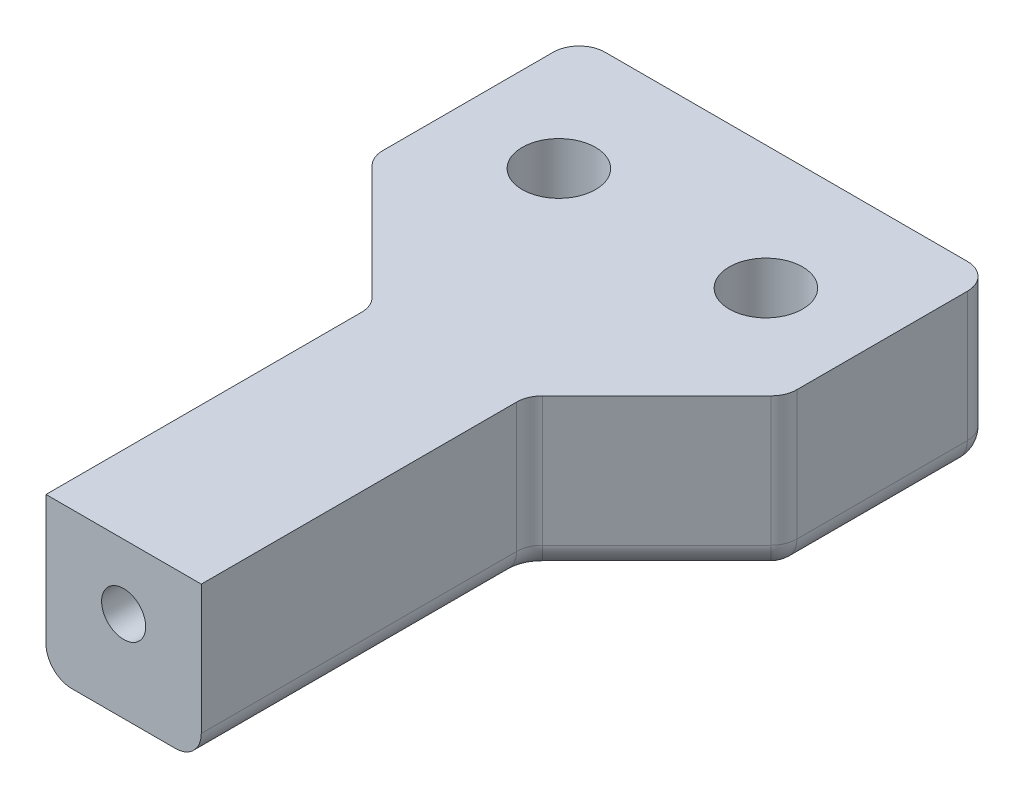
ISO-10303-21;
HEADER;
FILE_DESCRIPTION(('STEP AP214'),'2;1');
FILE_NAME('part.step','',(''),(''),'','','');
FILE_SCHEMA(('AUTOMOTIVE_DESIGN { 1 0 10303 214 1 1 1 1 }'));
ENDSEC;
DATA;
#1=APPLICATION_CONTEXT('core data for automotive mechanical design processes');
#2=APPLICATION_PROTOCOL_DEFINITION('international standard','automotive_design',2000,#1);
#3=PRODUCT_CONTEXT('',#1,'mechanical');
#4=PRODUCT('Part','Part','',(#3));
#5=PRODUCT_RELATED_PRODUCT_CATEGORY('part','',(#4));
#6=PRODUCT_DEFINITION_FORMATION('','',#4);
#7=PRODUCT_DEFINITION_CONTEXT('part definition',#1,'design');
#8=PRODUCT_DEFINITION('design','',#6,#7);
#9=PRODUCT_DEFINITION_SHAPE('','',#8);
#10=(LENGTH_UNIT() NAMED_UNIT(*) SI_UNIT(.MILLI.,.METRE.));
#11=(NAMED_UNIT(*) PLANE_ANGLE_UNIT() SI_UNIT($,.RADIAN.));
#12=(NAMED_UNIT(*) SI_UNIT($,.STERADIAN.) SOLID_ANGLE_UNIT());
#13=UNCERTAINTY_MEASURE_WITH_UNIT(LENGTH_MEASURE(1.E-05),#10,'distance_accuracy_value','');
#14=(GEOMETRIC_REPRESENTATION_CONTEXT(3) GLOBAL_UNCERTAINTY_ASSIGNED_CONTEXT((#13)) GLOBAL_UNIT_ASSIGNED_CONTEXT((#10,
#11,#12)) REPRESENTATION_CONTEXT('',''));
#15=CARTESIAN_POINT('',(0.,0.,0.));
#16=DIRECTION('',(0.,0.,1.));
#17=DIRECTION('',(1.,0.,0.));
#18=AXIS2_PLACEMENT_3D('',#15,#16,#17);
#19=CARTESIAN_POINT('',(-12.7,9.525,63.5));
#20=DIRECTION('',(1.,0.,0.));
#21=DIRECTION('',(0.,0.,-1.));
#22=AXIS2_PLACEMENT_3D('',#19,#20,#21);
#23=PLANE('',#22);
#24=DIRECTION('',(0.,0.,1.));
#25=VECTOR('',#24,1.);
#26=CARTESIAN_POINT('',(-12.7,1.5875,63.5));
#27=LINE('',#26,#25);
#28=CARTESIAN_POINT('',(-12.7,1.5875,52.3875));
#29=VERTEX_POINT('',#28);
#30=CARTESIAN_POINT('',(-12.7,1.5875,62.8424359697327));
#31=VERTEX_POINT('',#30);
#32=EDGE_CURVE('E396',#29,#31,#27,.T.);
#33=ORIENTED_EDGE('',*,*,#32,.T.);
#34=DIRECTION('',(0.,1.,0.));
#35=VECTOR('',#34,1.);
#36=CARTESIAN_POINT('',(-12.7,9.525,62.8424359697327));
#37=LINE('',#36,#35);
#38=CARTESIAN_POINT('',(-12.7,9.525,62.8424359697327));
#39=VERTEX_POINT('',#38);
#40=EDGE_CURVE('E399',#31,#39,#37,.T.);
#41=ORIENTED_EDGE('',*,*,#40,.T.);
#42=DIRECTION('',(0.,0.,1.));
#43=VECTOR('',#42,1.);
#44=CARTESIAN_POINT('',(-12.7,9.525,63.5));
#45=LINE('',#44,#43);
#46=CARTESIAN_POINT('',(-12.7,9.525,52.3875));
#47=VERTEX_POINT('',#46);
#48=EDGE_CURVE('E265',#47,#39,#45,.T.);
#49=ORIENTED_EDGE('',*,*,#48,.F.);
#50=DIRECTION('',(0.,-1.,0.));
#51=VECTOR('',#50,1.);
#52=CARTESIAN_POINT('',(-12.7,9.525,52.3875));
#53=LINE('',#52,#51);
#54=EDGE_CURVE('E393',#47,#29,#53,.T.);
#55=ORIENTED_EDGE('',*,*,#54,.T.);
#56=EDGE_LOOP('',(#33,#41,#49,#55));
#57=FACE_BOUND('',#56,.T.);
#58=ADVANCED_FACE('F41',(#57),#23,.F.);
#59=CARTESIAN_POINT('',(-4.7625,9.525,91.44));
#60=DIRECTION('',(1.,0.,0.));
#61=DIRECTION('',(0.,0.,-1.));
#62=AXIS2_PLACEMENT_3D('',#59,#60,#61);
#63=PLANE('',#62);
#64=DIRECTION('',(0.,1.,0.));
#65=VECTOR('',#64,1.);
#66=CARTESIAN_POINT('',(-4.76249999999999,0.,72.0950640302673));
#67=LINE('',#66,#65);
#68=CARTESIAN_POINT('',(-4.76249999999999,9.525,72.0950640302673));
#69=VERTEX_POINT('',#68);
#70=CARTESIAN_POINT('',(-4.76249999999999,1.5875,72.0950640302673));
#71=VERTEX_POINT('',#70);
#72=EDGE_CURVE('E348',#69,#71,#67,.F.);
#73=ORIENTED_EDGE('',*,*,#72,.T.);
#74=DIRECTION('',(0.,0.,1.));
#75=VECTOR('',#74,1.);
#76=CARTESIAN_POINT('',(-4.7625,1.5875,91.44));
#77=LINE('',#76,#75);
#78=CARTESIAN_POINT('',(-4.7625,1.5875,91.44));
#79=VERTEX_POINT('',#78);
#80=EDGE_CURVE('E351',#71,#79,#77,.T.);
#81=ORIENTED_EDGE('',*,*,#80,.T.);
#82=DIRECTION('',(0.,-1.,0.));
#83=VECTOR('',#82,1.);
#84=CARTESIAN_POINT('',(-4.7625,9.525,91.44));
#85=LINE('',#84,#83);
#86=CARTESIAN_POINT('',(-4.7625,9.525,91.44));
#87=VERTEX_POINT('',#86);
#88=EDGE_CURVE('E294',#87,#79,#85,.T.);
#89=ORIENTED_EDGE('',*,*,#88,.F.);
#90=DIRECTION('',(0.,0.,1.));
#91=VECTOR('',#90,1.);
#92=CARTESIAN_POINT('',(-4.7625,9.525,91.44));
#93=LINE('',#92,#91);
#94=EDGE_CURVE('E269',#69,#87,#93,.T.);
#95=ORIENTED_EDGE('',*,*,#94,.F.);
#96=EDGE_LOOP('',(#73,#81,#89,#95));
#97=FACE_BOUND('',#96,.T.);
#98=ADVANCED_FACE('F503',(#97),#63,.F.);
#99=CARTESIAN_POINT('',(4.7625,9.525,91.44));
#100=DIRECTION('',(0.,0.,-1.));
#101=DIRECTION('',(-1.,0.,0.));
#102=AXIS2_PLACEMENT_3D('',#99,#100,#101);
#103=PLANE('',#102);
#104=CARTESIAN_POINT('',(0.,5.55625,91.44));
#105=DIRECTION('',(0.,0.,1.));
#106=DIRECTION('',(1.,0.,0.));
#107=AXIS2_PLACEMENT_3D('',#104,#105,#106);
#108=CIRCLE('',#107,1.35254999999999);
#109=CARTESIAN_POINT('',(1.35254999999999,5.55625,91.44));
#110=VERTEX_POINT('',#109);
#111=EDGE_CURVE('E225',#110,#110,#108,.T.);
#112=ORIENTED_EDGE('',*,*,#111,.F.);
#113=EDGE_LOOP('',(#112));
#114=FACE_BOUND('',#113,.T.);
#115=DIRECTION('',(1.,0.,0.));
#116=VECTOR('',#115,1.);
#117=CARTESIAN_POINT('',(4.7625,0.,91.44));
#118=LINE('',#117,#116);
#119=CARTESIAN_POINT('',(-3.175,0.,91.44));
#120=VERTEX_POINT('',#119);
#121=CARTESIAN_POINT('',(3.175,0.,91.44));
#122=VERTEX_POINT('',#121);
#123=EDGE_CURVE('E270',#120,#122,#118,.T.);
#124=ORIENTED_EDGE('',*,*,#123,.T.);
#125=CARTESIAN_POINT('',(3.175,1.5875,91.44));
#126=DIRECTION('',(0.,0.,-1.));
#127=DIRECTION('',(-1.,0.,0.));
#128=AXIS2_PLACEMENT_3D('',#125,#126,#127);
#129=CIRCLE('',#128,1.5875);
#130=CARTESIAN_POINT('',(4.7625,1.5875,91.44));
#131=VERTEX_POINT('',#130);
#132=EDGE_CURVE('E345',#122,#131,#129,.F.);
#133=ORIENTED_EDGE('',*,*,#132,.T.);
#134=DIRECTION('',(0.,-1.,0.));
#135=VECTOR('',#134,1.);
#136=CARTESIAN_POINT('',(4.7625,9.525,91.44));
#137=LINE('',#136,#135);
#138=CARTESIAN_POINT('',(4.7625,9.525,91.44));
#139=VERTEX_POINT('',#138);
#140=EDGE_CURVE('E288',#139,#131,#137,.T.);
#141=ORIENTED_EDGE('',*,*,#140,.F.);
#142=DIRECTION('',(1.,0.,0.));
#143=VECTOR('',#142,1.);
#144=CARTESIAN_POINT('',(4.7625,9.525,91.44));
#145=LINE('',#144,#143);
#146=EDGE_CURVE('E273',#87,#139,#145,.T.);
#147=ORIENTED_EDGE('',*,*,#146,.F.);
#148=ORIENTED_EDGE('',*,*,#88,.T.);
#149=CARTESIAN_POINT('',(-3.175,1.5875,91.44));
#150=DIRECTION('',(0.,0.,-1.));
#151=DIRECTION('',(-1.,0.,0.));
#152=AXIS2_PLACEMENT_3D('',#149,#150,#151);
#153=CIRCLE('',#152,1.5875);
#154=EDGE_CURVE('E342',#79,#120,#153,.F.);
#155=ORIENTED_EDGE('',*,*,#154,.T.);
#156=EDGE_LOOP('',(#124,#133,#141,#147,#148,#155));
#157=FACE_BOUND('',#156,.T.);
#158=ADVANCED_FACE('F507',(#114,#157),#103,.F.);
#159=CARTESIAN_POINT('',(4.76250000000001,9.525,63.5));
#160=DIRECTION('',(-1.,0.,0.));
#161=DIRECTION('',(0.,0.,1.));
#162=AXIS2_PLACEMENT_3D('',#159,#160,#161);
#163=PLANE('',#162);
#164=ORIENTED_EDGE('',*,*,#140,.T.);
#165=DIRECTION('',(0.,0.,-1.));
#166=VECTOR('',#165,1.);
#167=CARTESIAN_POINT('',(4.76250000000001,1.5875,71.4375));
#168=LINE('',#167,#166);
#169=CARTESIAN_POINT('',(4.76250000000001,1.5875,72.0950640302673));
#170=VERTEX_POINT('',#169);
#171=EDGE_CURVE('E309',#131,#170,#168,.T.);
#172=ORIENTED_EDGE('',*,*,#171,.T.);
#173=DIRECTION('',(0.,-1.,0.));
#174=VECTOR('',#173,1.);
#175=CARTESIAN_POINT('',(4.76250000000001,9.525,72.0950640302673));
#176=LINE('',#175,#174);
#177=CARTESIAN_POINT('',(4.76250000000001,9.525,72.0950640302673));
#178=VERTEX_POINT('',#177);
#179=EDGE_CURVE('E306',#170,#178,#176,.F.);
#180=ORIENTED_EDGE('',*,*,#179,.T.);
#181=DIRECTION('',(0.,0.,-1.));
#182=VECTOR('',#181,1.);
#183=CARTESIAN_POINT('',(4.76250000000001,9.525,63.5));
#184=LINE('',#183,#182);
#185=EDGE_CURVE('E276',#139,#178,#184,.T.);
#186=ORIENTED_EDGE('',*,*,#185,.F.);
#187=EDGE_LOOP('',(#164,#172,#180,#186));
#188=FACE_BOUND('',#187,.T.);
#189=ADVANCED_FACE('F561',(#188),#163,.F.);
#190=CARTESIAN_POINT('',(12.7,9.525,50.8));
#191=DIRECTION('',(-1.,0.,0.));
#192=DIRECTION('',(0.,0.,1.));
#193=AXIS2_PLACEMENT_3D('',#190,#191,#192);
#194=PLANE('',#193);
#195=DIRECTION('',(0.,0.,-1.));
#196=VECTOR('',#195,1.);
#197=CARTESIAN_POINT('',(12.7,9.525,50.8));
#198=LINE('',#197,#196);
#199=CARTESIAN_POINT('',(12.7,9.525,62.8424359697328));
#200=VERTEX_POINT('',#199);
#201=CARTESIAN_POINT('',(12.7,9.525,52.3875));
#202=VERTEX_POINT('',#201);
#203=EDGE_CURVE('E280',#200,#202,#198,.T.);
#204=ORIENTED_EDGE('',*,*,#203,.F.);
#205=DIRECTION('',(0.,1.,0.));
#206=VECTOR('',#205,1.);
#207=CARTESIAN_POINT('',(12.7,9.525,62.8424359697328));
#208=LINE('',#207,#206);
#209=CARTESIAN_POINT('',(12.7,1.5875,62.8424359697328));
#210=VERTEX_POINT('',#209);
#211=EDGE_CURVE('E378',#200,#210,#208,.F.);
#212=ORIENTED_EDGE('',*,*,#211,.T.);
#213=DIRECTION('',(0.,0.,-1.));
#214=VECTOR('',#213,1.);
#215=CARTESIAN_POINT('',(12.7,1.5875,50.8));
#216=LINE('',#215,#214);
#217=CARTESIAN_POINT('',(12.7,1.5875,52.3875));
#218=VERTEX_POINT('',#217);
#219=EDGE_CURVE('E375',#210,#218,#216,.T.);
#220=ORIENTED_EDGE('',*,*,#219,.T.);
#221=DIRECTION('',(0.,-1.,0.));
#222=VECTOR('',#221,1.);
#223=CARTESIAN_POINT('',(12.7,9.525,52.3875));
#224=LINE('',#223,#222);
#225=EDGE_CURVE('E372',#218,#202,#224,.F.);
#226=ORIENTED_EDGE('',*,*,#225,.T.);
#227=EDGE_LOOP('',(#204,#212,#220,#226));
#228=FACE_BOUND('',#227,.T.);
#229=ADVANCED_FACE('F577',(#228),#194,.F.);
#230=CARTESIAN_POINT('',(-12.7,9.525,50.8));
#231=DIRECTION('',(0.,0.,1.));
#232=DIRECTION('',(1.,0.,0.));
#233=AXIS2_PLACEMENT_3D('',#230,#231,#232);
#234=PLANE('',#233);
#235=DIRECTION('',(-1.,0.,0.));
#236=VECTOR('',#235,1.);
#237=CARTESIAN_POINT('',(-12.7,9.525,50.8));
#238=LINE('',#237,#236);
#239=CARTESIAN_POINT('',(11.1125,9.525,50.8));
#240=VERTEX_POINT('',#239);
#241=CARTESIAN_POINT('',(-11.1125,9.525,50.8));
#242=VERTEX_POINT('',#241);
#243=EDGE_CURVE('E284',#240,#242,#238,.T.);
#244=ORIENTED_EDGE('',*,*,#243,.F.);
#245=DIRECTION('',(0.,-1.,0.));
#246=VECTOR('',#245,1.);
#247=CARTESIAN_POINT('',(11.1125,9.525,50.8));
#248=LINE('',#247,#246);
#249=CARTESIAN_POINT('',(11.1125,1.5875,50.8));
#250=VERTEX_POINT('',#249);
#251=EDGE_CURVE('E62',#240,#250,#248,.T.);
#252=ORIENTED_EDGE('',*,*,#251,.T.);
#253=DIRECTION('',(-1.,0.,0.));
#254=VECTOR('',#253,1.);
#255=CARTESIAN_POINT('',(-12.7,1.5875,50.8));
#256=LINE('',#255,#254);
#257=CARTESIAN_POINT('',(-11.1125,1.5875,50.8));
#258=VERTEX_POINT('',#257);
#259=EDGE_CURVE('E67',#250,#258,#256,.T.);
#260=ORIENTED_EDGE('',*,*,#259,.T.);
#261=DIRECTION('',(0.,-1.,0.));
#262=VECTOR('',#261,1.);
#263=CARTESIAN_POINT('',(-11.1125,9.525,50.8));
#264=LINE('',#263,#262);
#265=EDGE_CURVE('E402',#258,#242,#264,.F.);
#266=ORIENTED_EDGE('',*,*,#265,.T.);
#267=EDGE_LOOP('',(#244,#252,#260,#266));
#268=FACE_BOUND('',#267,.T.);
#269=ADVANCED_FACE('F843',(#268),#234,.F.);
#270=CARTESIAN_POINT('',(0.,9.525,0.));
#271=DIRECTION('',(0.,-1.,0.));
#272=DIRECTION('',(0.,0.,-1.));
#273=AXIS2_PLACEMENT_3D('',#270,#271,#272);
#274=PLANE('',#273);
#275=CARTESIAN_POINT('',(-6.35,9.525,58.3932479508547));
#276=DIRECTION('',(0.,-1.,0.));
#277=DIRECTION('',(0.,0.,-1.));
#278=AXIS2_PLACEMENT_3D('',#275,#276,#277);
#279=CIRCLE('',#278,2.2479);
#280=CARTESIAN_POINT('',(-6.35,9.525,56.1453479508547));
#281=VERTEX_POINT('',#280);
#282=EDGE_CURVE('E244',#281,#281,#279,.T.);
#283=ORIENTED_EDGE('',*,*,#282,.T.);
#284=EDGE_LOOP('',(#283));
#285=FACE_BOUND('',#284,.T.);
#286=CARTESIAN_POINT('',(6.35,9.525,58.3932479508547));
#287=DIRECTION('',(0.,-1.,0.));
#288=DIRECTION('',(0.,0.,-1.));
#289=AXIS2_PLACEMENT_3D('',#286,#287,#288);
#290=CIRCLE('',#289,2.2479);
#291=CARTESIAN_POINT('',(6.35,9.525,56.1453479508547));
#292=VERTEX_POINT('',#291);
#293=EDGE_CURVE('E260',#292,#292,#290,.T.);
#294=ORIENTED_EDGE('',*,*,#293,.T.);
#295=EDGE_LOOP('',(#294));
#296=FACE_BOUND('',#295,.T.);
#297=DIRECTION('',(-0.707106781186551,0.,0.707106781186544));
#298=VECTOR('',#297,1.);
#299=CARTESIAN_POINT('',(38.1,9.525,38.1000000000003));
#300=LINE('',#299,#298);
#301=CARTESIAN_POINT('',(5.22746798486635,9.525,70.9725320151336));
#302=VERTEX_POINT('',#301);
#303=CARTESIAN_POINT('',(12.2350320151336,9.525,63.9649679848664));
#304=VERTEX_POINT('',#303);
#305=EDGE_CURVE('E298',#302,#304,#300,.F.);
#306=ORIENTED_EDGE('',*,*,#305,.T.);
#307=CARTESIAN_POINT('',(11.1125,9.525,62.8424359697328));
#308=DIRECTION('',(0.,-1.,0.));
#309=DIRECTION('',(0.,0.,-1.));
#310=AXIS2_PLACEMENT_3D('',#307,#308,#309);
#311=CIRCLE('',#310,1.5875);
#312=EDGE_CURVE('E390',#304,#200,#311,.F.);
#313=ORIENTED_EDGE('',*,*,#312,.T.);
#314=ORIENTED_EDGE('',*,*,#203,.T.);
#315=CARTESIAN_POINT('',(11.1125,9.525,52.3875));
#316=DIRECTION('',(0.,-1.,0.));
#317=DIRECTION('',(0.,0.,-1.));
#318=AXIS2_PLACEMENT_3D('',#315,#316,#317);
#319=CIRCLE('',#318,1.5875);
#320=EDGE_CURVE('E384',#202,#240,#319,.F.);
#321=ORIENTED_EDGE('',*,*,#320,.T.);
#322=ORIENTED_EDGE('',*,*,#243,.T.);
#323=CARTESIAN_POINT('',(-11.1125,9.525,52.3875));
#324=DIRECTION('',(0.,-1.,0.));
#325=DIRECTION('',(0.,0.,-1.));
#326=AXIS2_PLACEMENT_3D('',#323,#324,#325);
#327=CIRCLE('',#326,1.5875);
#328=EDGE_CURVE('E381',#242,#47,#327,.F.);
#329=ORIENTED_EDGE('',*,*,#328,.T.);
#330=ORIENTED_EDGE('',*,*,#48,.T.);
#331=CARTESIAN_POINT('',(-11.1125,9.525,62.8424359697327));
#332=DIRECTION('',(0.,-1.,0.));
#333=DIRECTION('',(0.,0.,-1.));
#334=AXIS2_PLACEMENT_3D('',#331,#332,#333);
#335=CIRCLE('',#334,1.5875);
#336=CARTESIAN_POINT('',(-12.2350320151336,9.525,63.9649679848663));
#337=VERTEX_POINT('',#336);
#338=EDGE_CURVE('E387',#39,#337,#335,.F.);
#339=ORIENTED_EDGE('',*,*,#338,.T.);
#340=DIRECTION('',(-0.707106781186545,0.,-0.70710678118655));
#341=VECTOR('',#340,1.);
#342=CARTESIAN_POINT('',(-38.1,9.525,38.0999999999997));
#343=LINE('',#342,#341);
#344=CARTESIAN_POINT('',(-5.22746798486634,9.525,70.9725320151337));
#345=VERTEX_POINT('',#344);
#346=EDGE_CURVE('E302',#337,#345,#343,.F.);
#347=ORIENTED_EDGE('',*,*,#346,.T.);
#348=CARTESIAN_POINT('',(-6.34999999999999,9.525,72.0950640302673));
#349=DIRECTION('',(0.,-1.,0.));
#350=DIRECTION('',(0.,0.,-1.));
#351=AXIS2_PLACEMENT_3D('',#348,#349,#350);
#352=CIRCLE('',#351,1.5875);
#353=EDGE_CURVE('E51',#345,#69,#352,.T.);
#354=ORIENTED_EDGE('',*,*,#353,.T.);
#355=ORIENTED_EDGE('',*,*,#94,.T.);
#356=ORIENTED_EDGE('',*,*,#146,.T.);
#357=ORIENTED_EDGE('',*,*,#185,.T.);
#358=CARTESIAN_POINT('',(6.35,9.525,72.0950640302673));
#359=DIRECTION('',(0.,-1.,0.));
#360=DIRECTION('',(0.,0.,-1.));
#361=AXIS2_PLACEMENT_3D('',#358,#359,#360);
#362=CIRCLE('',#361,1.5875);
#363=EDGE_CURVE('E11',#178,#302,#362,.T.);
#364=ORIENTED_EDGE('',*,*,#363,.T.);
#365=EDGE_LOOP('',(#306,#313,#314,#321,#322,#329,#330,#339,#347,#354,#355,#356,#357,#364));
#366=FACE_BOUND('',#365,.T.);
#367=ADVANCED_FACE('F511',(#285,#296,#366),#274,.F.);
#368=CARTESIAN_POINT('',(0.,0.,0.));
#369=DIRECTION('',(0.,-1.,0.));
#370=DIRECTION('',(0.,0.,-1.));
#371=AXIS2_PLACEMENT_3D('',#368,#369,#370);
#372=PLANE('',#371);
#373=CARTESIAN_POINT('',(-6.35,0.,58.3932479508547));
#374=DIRECTION('',(0.,-1.,0.));
#375=DIRECTION('',(0.,0.,-1.));
#376=AXIS2_PLACEMENT_3D('',#373,#374,#375);
#377=CIRCLE('',#376,3.96875);
#378=CARTESIAN_POINT('',(-6.35,0.,54.4244979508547));
#379=VERTEX_POINT('',#378);
#380=EDGE_CURVE('E224',#379,#379,#377,.T.);
#381=ORIENTED_EDGE('',*,*,#380,.F.);
#382=EDGE_LOOP('',(#381));
#383=FACE_BOUND('',#382,.T.);
#384=CARTESIAN_POINT('',(6.35,0.,58.3932479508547));
#385=DIRECTION('',(0.,-1.,0.));
#386=DIRECTION('',(0.,0.,-1.));
#387=AXIS2_PLACEMENT_3D('',#384,#385,#386);
#388=CIRCLE('',#387,3.96875);
#389=CARTESIAN_POINT('',(6.35,0.,54.4244979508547));
#390=VERTEX_POINT('',#389);
#391=EDGE_CURVE('E248',#390,#390,#388,.T.);
#392=ORIENTED_EDGE('',*,*,#391,.F.);
#393=EDGE_LOOP('',(#392));
#394=FACE_BOUND('',#393,.T.);
#395=CARTESIAN_POINT('',(6.35,0.,72.0950640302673));
#396=DIRECTION('',(0.,-1.,0.));
#397=DIRECTION('',(0.,0.,-1.));
#398=AXIS2_PLACEMENT_3D('',#395,#396,#397);
#399=CIRCLE('',#398,3.175);
#400=CARTESIAN_POINT('',(3.17500000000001,0.,72.0950640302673));
#401=VERTEX_POINT('',#400);
#402=CARTESIAN_POINT('',(4.10493596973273,0.,69.85));
#403=VERTEX_POINT('',#402);
#404=EDGE_CURVE('E335',#401,#403,#399,.T.);
#405=ORIENTED_EDGE('',*,*,#404,.F.);
#406=DIRECTION('',(0.,0.,-1.));
#407=VECTOR('',#406,1.);
#408=CARTESIAN_POINT('',(3.175,0.,91.44));
#409=LINE('',#408,#407);
#410=EDGE_CURVE('E339',#401,#122,#409,.F.);
#411=ORIENTED_EDGE('',*,*,#410,.T.);
#412=ORIENTED_EDGE('',*,*,#123,.F.);
#413=DIRECTION('',(0.,0.,1.));
#414=VECTOR('',#413,1.);
#415=CARTESIAN_POINT('',(-3.17499999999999,0.,71.4375));
#416=LINE('',#415,#414);
#417=CARTESIAN_POINT('',(-3.17499999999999,0.,72.0950640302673));
#418=VERTEX_POINT('',#417);
#419=EDGE_CURVE('E332',#120,#418,#416,.F.);
#420=ORIENTED_EDGE('',*,*,#419,.T.);
#421=CARTESIAN_POINT('',(-6.34999999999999,0.,72.0950640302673));
#422=DIRECTION('',(0.,-1.,0.));
#423=DIRECTION('',(0.,0.,-1.));
#424=AXIS2_PLACEMENT_3D('',#421,#422,#423);
#425=CIRCLE('',#424,3.175);
#426=CARTESIAN_POINT('',(-4.1049359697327,0.,69.85));
#427=VERTEX_POINT('',#426);
#428=EDGE_CURVE('E328',#427,#418,#425,.T.);
#429=ORIENTED_EDGE('',*,*,#428,.F.);
#430=DIRECTION('',(0.707106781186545,0.,0.70710678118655));
#431=VECTOR('',#430,1.);
#432=CARTESIAN_POINT('',(-11.5774679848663,0.,62.3774679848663));
#433=LINE('',#432,#431);
#434=CARTESIAN_POINT('',(-11.1125,0.,62.8424359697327));
#435=VERTEX_POINT('',#434);
#436=EDGE_CURVE('E322',#427,#435,#433,.F.);
#437=ORIENTED_EDGE('',*,*,#436,.T.);
#438=DIRECTION('',(0.,0.,1.));
#439=VECTOR('',#438,1.);
#440=CARTESIAN_POINT('',(-11.1125,0.,50.8));
#441=LINE('',#440,#439);
#442=CARTESIAN_POINT('',(-11.1125,0.,52.3875));
#443=VERTEX_POINT('',#442);
#444=EDGE_CURVE('E319',#435,#443,#441,.F.);
#445=ORIENTED_EDGE('',*,*,#444,.T.);
#446=DIRECTION('',(-1.,0.,0.));
#447=VECTOR('',#446,1.);
#448=CARTESIAN_POINT('',(12.7,0.,52.3875));
#449=LINE('',#448,#447);
#450=CARTESIAN_POINT('',(11.1125,0.,52.3875));
#451=VERTEX_POINT('',#450);
#452=EDGE_CURVE('E316',#443,#451,#449,.F.);
#453=ORIENTED_EDGE('',*,*,#452,.T.);
#454=DIRECTION('',(0.,0.,-1.));
#455=VECTOR('',#454,1.);
#456=CARTESIAN_POINT('',(11.1125,0.,63.5));
#457=LINE('',#456,#455);
#458=CARTESIAN_POINT('',(11.1125,0.,62.8424359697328));
#459=VERTEX_POINT('',#458);
#460=EDGE_CURVE('E313',#451,#459,#457,.F.);
#461=ORIENTED_EDGE('',*,*,#460,.T.);
#462=DIRECTION('',(0.707106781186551,0.,-0.707106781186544));
#463=VECTOR('',#462,1.);
#464=CARTESIAN_POINT('',(3.63996798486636,0.,70.3149679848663));
#465=LINE('',#464,#463);
#466=EDGE_CURVE('E325',#459,#403,#465,.F.);
#467=ORIENTED_EDGE('',*,*,#466,.T.);
#468=EDGE_LOOP('',(#405,#411,#412,#420,#429,#437,#445,#453,#461,#467));
#469=FACE_BOUND('',#468,.T.);
#470=ADVANCED_FACE('F492',(#383,#394,#469),#372,.T.);
#471=CARTESIAN_POINT('',(12.7000000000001,9.525,63.5));
#472=DIRECTION('',(0.707106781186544,0.,0.707106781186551));
#473=DIRECTION('',(0.,1.,0.));
#474=AXIS2_PLACEMENT_3D('',#471,#472,#473);
#475=PLANE('',#474);
#476=ORIENTED_EDGE('',*,*,#305,.F.);
#477=DIRECTION('',(0.,1.,0.));
#478=VECTOR('',#477,1.);
#479=CARTESIAN_POINT('',(5.22746798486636,0.,70.9725320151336));
#480=LINE('',#479,#478);
#481=CARTESIAN_POINT('',(5.22746798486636,1.5875,70.9725320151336));
#482=VERTEX_POINT('',#481);
#483=EDGE_CURVE('E360',#302,#482,#480,.F.);
#484=ORIENTED_EDGE('',*,*,#483,.T.);
#485=DIRECTION('',(-0.707106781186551,0.,0.707106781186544));
#486=VECTOR('',#485,1.);
#487=CARTESIAN_POINT('',(12.7,1.5875,63.5));
#488=LINE('',#487,#486);
#489=CARTESIAN_POINT('',(12.2350320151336,1.5875,63.9649679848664));
#490=VERTEX_POINT('',#489);
#491=EDGE_CURVE('E357',#482,#490,#488,.F.);
#492=ORIENTED_EDGE('',*,*,#491,.T.);
#493=DIRECTION('',(0.,-1.,0.));
#494=VECTOR('',#493,1.);
#495=CARTESIAN_POINT('',(12.2350320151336,9.525,63.9649679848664));
#496=LINE('',#495,#494);
#497=EDGE_CURVE('E354',#490,#304,#496,.F.);
#498=ORIENTED_EDGE('',*,*,#497,.T.);
#499=EDGE_LOOP('',(#476,#484,#492,#498));
#500=FACE_BOUND('',#499,.T.);
#501=ADVANCED_FACE('F569',(#500),#475,.T.);
#502=CARTESIAN_POINT('',(-4.76249999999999,9.525,71.4375));
#503=DIRECTION('',(-0.70710678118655,0.,0.707106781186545));
#504=DIRECTION('',(0.,1.,0.));
#505=AXIS2_PLACEMENT_3D('',#502,#503,#504);
#506=PLANE('',#505);
#507=DIRECTION('',(-0.707106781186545,0.,-0.70710678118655));
#508=VECTOR('',#507,1.);
#509=CARTESIAN_POINT('',(-4.76249999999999,1.5875,71.4375));
#510=LINE('',#509,#508);
#511=CARTESIAN_POINT('',(-12.2350320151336,1.5875,63.9649679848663));
#512=VERTEX_POINT('',#511);
#513=CARTESIAN_POINT('',(-5.22746798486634,1.5875,70.9725320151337));
#514=VERTEX_POINT('',#513);
#515=EDGE_CURVE('E366',#512,#514,#510,.F.);
#516=ORIENTED_EDGE('',*,*,#515,.T.);
#517=DIRECTION('',(0.,-1.,0.));
#518=VECTOR('',#517,1.);
#519=CARTESIAN_POINT('',(-5.22746798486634,9.525,70.9725320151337));
#520=LINE('',#519,#518);
#521=EDGE_CURVE('E369',#514,#345,#520,.F.);
#522=ORIENTED_EDGE('',*,*,#521,.T.);
#523=ORIENTED_EDGE('',*,*,#346,.F.);
#524=DIRECTION('',(0.,-1.,0.));
#525=VECTOR('',#524,1.);
#526=CARTESIAN_POINT('',(-12.2350320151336,9.525,63.9649679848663));
#527=LINE('',#526,#525);
#528=EDGE_CURVE('E363',#337,#512,#527,.T.);
#529=ORIENTED_EDGE('',*,*,#528,.T.);
#530=EDGE_LOOP('',(#516,#522,#523,#529));
#531=FACE_BOUND('',#530,.T.);
#532=ADVANCED_FACE('F516',(#531),#506,.T.);
#533=CARTESIAN_POINT('',(-6.34999999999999,9.525,72.0950640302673));
#534=DIRECTION('',(0.,-1.,0.));
#535=DIRECTION('',(0.,0.,-1.));
#536=AXIS2_PLACEMENT_3D('',#533,#534,#535);
#537=CYLINDRICAL_SURFACE('',#536,1.5875);
#538=ORIENTED_EDGE('',*,*,#353,.F.);
#539=ORIENTED_EDGE('',*,*,#521,.F.);
#540=CARTESIAN_POINT('',(-6.34999999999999,1.5875,72.0950640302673));
#541=DIRECTION('',(0.,-1.,0.));
#542=DIRECTION('',(0.,0.,-1.));
#543=AXIS2_PLACEMENT_3D('',#540,#541,#542);
#544=CIRCLE('',#543,1.5875);
#545=EDGE_CURVE('E45',#71,#514,#544,.F.);
#546=ORIENTED_EDGE('',*,*,#545,.F.);
#547=ORIENTED_EDGE('',*,*,#72,.F.);
#548=EDGE_LOOP('',(#538,#539,#546,#547));
#549=FACE_BOUND('',#548,.T.);
#550=ADVANCED_FACE('F43',(#549),#537,.F.);
#551=CARTESIAN_POINT('',(-3.175,1.5875,91.44));
#552=DIRECTION('',(0.,0.,-1.));
#553=DIRECTION('',(-1.,0.,0.));
#554=AXIS2_PLACEMENT_3D('',#551,#552,#553);
#555=CYLINDRICAL_SURFACE('',#554,1.5875);
#556=ORIENTED_EDGE('',*,*,#154,.F.);
#557=ORIENTED_EDGE('',*,*,#80,.F.);
#558=CARTESIAN_POINT('',(-3.17499999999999,1.5875,72.0950640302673));
#559=DIRECTION('',(0.,0.,-1.));
#560=DIRECTION('',(-1.,0.,0.));
#561=AXIS2_PLACEMENT_3D('',#558,#559,#560);
#562=CIRCLE('',#561,1.5875);
#563=EDGE_CURVE('E471',#418,#71,#562,.T.);
#564=ORIENTED_EDGE('',*,*,#563,.F.);
#565=ORIENTED_EDGE('',*,*,#419,.F.);
#566=EDGE_LOOP('',(#556,#557,#564,#565));
#567=FACE_BOUND('',#566,.T.);
#568=ADVANCED_FACE('F500',(#567),#555,.T.);
#569=CARTESIAN_POINT('',(-6.34999999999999,1.5875,72.0950640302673));
#570=DIRECTION('',(0.,-1.,0.));
#571=DIRECTION('',(0.,0.,-1.));
#572=AXIS2_PLACEMENT_3D('',#569,#570,#571);
#573=TOROIDAL_SURFACE('',#572,3.175,1.5875);
#574=ORIENTED_EDGE('',*,*,#563,.T.);
#575=ORIENTED_EDGE('',*,*,#545,.T.);
#576=CARTESIAN_POINT('',(-4.10493596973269,1.5875,69.85));
#577=DIRECTION('',(0.707106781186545,0.,0.70710678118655));
#578=DIRECTION('',(0.70710678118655,0.,-0.707106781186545));
#579=AXIS2_PLACEMENT_3D('',#576,#577,#578);
#580=CIRCLE('',#579,1.5875);
#581=EDGE_CURVE('E468',#427,#514,#580,.F.);
#582=ORIENTED_EDGE('',*,*,#581,.F.);
#583=ORIENTED_EDGE('',*,*,#428,.T.);
#584=EDGE_LOOP('',(#574,#575,#582,#583));
#585=FACE_BOUND('',#584,.T.);
#586=ADVANCED_FACE('F480',(#585),#573,.T.);
#587=CARTESIAN_POINT('',(-11.1125,9.525,62.8424359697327));
#588=DIRECTION('',(0.,1.,0.));
#589=DIRECTION('',(0.,0.,1.));
#590=AXIS2_PLACEMENT_3D('',#587,#588,#589);
#591=CYLINDRICAL_SURFACE('',#590,1.5875);
#592=ORIENTED_EDGE('',*,*,#338,.F.);
#593=ORIENTED_EDGE('',*,*,#40,.F.);
#594=CARTESIAN_POINT('',(-11.1125,1.5875,62.8424359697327));
#595=DIRECTION('',(0.,-1.,0.));
#596=DIRECTION('',(0.,0.,-1.));
#597=AXIS2_PLACEMENT_3D('',#594,#595,#596);
#598=CIRCLE('',#597,1.5875);
#599=EDGE_CURVE('E464',#512,#31,#598,.T.);
#600=ORIENTED_EDGE('',*,*,#599,.F.);
#601=ORIENTED_EDGE('',*,*,#528,.F.);
#602=EDGE_LOOP('',(#592,#593,#600,#601));
#603=FACE_BOUND('',#602,.T.);
#604=ADVANCED_FACE('F522',(#603),#591,.T.);
#605=CARTESIAN_POINT('',(-36.9774679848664,1.5875,36.9774679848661));
#606=DIRECTION('',(-0.707106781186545,0.,-0.70710678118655));
#607=DIRECTION('',(-0.70710678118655,0.,0.707106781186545));
#608=AXIS2_PLACEMENT_3D('',#605,#606,#607);
#609=CYLINDRICAL_SURFACE('',#608,1.5875);
#610=ORIENTED_EDGE('',*,*,#581,.T.);
#611=ORIENTED_EDGE('',*,*,#515,.F.);
#612=CARTESIAN_POINT('',(-11.1125,1.5875,62.8424359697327));
#613=DIRECTION('',(-0.707106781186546,0.,-0.707106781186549));
#614=DIRECTION('',(-0.707106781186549,0.,0.707106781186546));
#615=AXIS2_PLACEMENT_3D('',#612,#613,#614);
#616=CIRCLE('',#615,1.5875);
#617=EDGE_CURVE('E460',#435,#512,#616,.T.);
#618=ORIENTED_EDGE('',*,*,#617,.F.);
#619=ORIENTED_EDGE('',*,*,#436,.F.);
#620=EDGE_LOOP('',(#610,#611,#618,#619));
#621=FACE_BOUND('',#620,.T.);
#622=ADVANCED_FACE('F487',(#621),#609,.T.);
#623=CARTESIAN_POINT('',(-11.1125,1.5875,62.8424359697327));
#624=DIRECTION('',(0.,0.,1.));
#625=DIRECTION('',(1.,0.,0.));
#626=AXIS2_PLACEMENT_3D('',#623,#624,#625);
#627=SPHERICAL_SURFACE('',#626,1.5875);
#628=ORIENTED_EDGE('',*,*,#617,.T.);
#629=ORIENTED_EDGE('',*,*,#599,.T.);
#630=CARTESIAN_POINT('',(-11.1125,1.5875,62.8424359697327));
#631=DIRECTION('',(0.,0.,1.));
#632=DIRECTION('',(1.,0.,0.));
#633=AXIS2_PLACEMENT_3D('',#630,#631,#632);
#634=CIRCLE('',#633,1.5875);
#635=EDGE_CURVE('E456',#435,#31,#634,.F.);
#636=ORIENTED_EDGE('',*,*,#635,.F.);
#637=EDGE_LOOP('',(#628,#629,#636));
#638=FACE_BOUND('',#637,.T.);
#639=ADVANCED_FACE('F524',(#638),#627,.T.);
#640=CARTESIAN_POINT('',(-11.1125,9.525,52.3875));
#641=DIRECTION('',(0.,-1.,0.));
#642=DIRECTION('',(0.,0.,-1.));
#643=AXIS2_PLACEMENT_3D('',#640,#641,#642);
#644=CYLINDRICAL_SURFACE('',#643,1.5875);
#645=ORIENTED_EDGE('',*,*,#328,.F.);
#646=ORIENTED_EDGE('',*,*,#265,.F.);
#647=CARTESIAN_POINT('',(-11.1125,1.5875,52.3875));
#648=DIRECTION('',(0.,-1.,0.));
#649=DIRECTION('',(0.,0.,-1.));
#650=AXIS2_PLACEMENT_3D('',#647,#648,#649);
#651=CIRCLE('',#650,1.5875);
#652=EDGE_CURVE('E452',#29,#258,#651,.T.);
#653=ORIENTED_EDGE('',*,*,#652,.F.);
#654=ORIENTED_EDGE('',*,*,#54,.F.);
#655=EDGE_LOOP('',(#645,#646,#653,#654));
#656=FACE_BOUND('',#655,.T.);
#657=ADVANCED_FACE('F770',(#656),#644,.T.);
#658=CARTESIAN_POINT('',(-11.1125,1.5875,63.5));
#659=DIRECTION('',(0.,0.,-1.));
#660=DIRECTION('',(-1.,0.,0.));
#661=AXIS2_PLACEMENT_3D('',#658,#659,#660);
#662=CYLINDRICAL_SURFACE('',#661,1.5875);
#663=ORIENTED_EDGE('',*,*,#635,.T.);
#664=ORIENTED_EDGE('',*,*,#32,.F.);
#665=CARTESIAN_POINT('',(-11.1125,1.5875,52.3875));
#666=DIRECTION('',(0.,0.,-1.));
#667=DIRECTION('',(-1.,0.,0.));
#668=AXIS2_PLACEMENT_3D('',#665,#666,#667);
#669=CIRCLE('',#668,1.5875);
#670=EDGE_CURVE('E448',#443,#29,#669,.T.);
#671=ORIENTED_EDGE('',*,*,#670,.F.);
#672=ORIENTED_EDGE('',*,*,#444,.F.);
#673=EDGE_LOOP('',(#663,#664,#671,#672));
#674=FACE_BOUND('',#673,.T.);
#675=ADVANCED_FACE('F527',(#674),#662,.T.);
#676=CARTESIAN_POINT('',(-11.1125,1.5875,52.3875));
#677=DIRECTION('',(0.,0.,1.));
#678=DIRECTION('',(1.,0.,0.));
#679=AXIS2_PLACEMENT_3D('',#676,#677,#678);
#680=SPHERICAL_SURFACE('',#679,1.5875);
#681=ORIENTED_EDGE('',*,*,#670,.T.);
#682=ORIENTED_EDGE('',*,*,#652,.T.);
#683=CARTESIAN_POINT('',(-11.1125,1.5875,52.3875));
#684=DIRECTION('',(-1.,0.,0.));
#685=DIRECTION('',(0.,0.,1.));
#686=AXIS2_PLACEMENT_3D('',#683,#684,#685);
#687=CIRCLE('',#686,1.5875);
#688=EDGE_CURVE('E444',#443,#258,#687,.F.);
#689=ORIENTED_EDGE('',*,*,#688,.F.);
#690=EDGE_LOOP('',(#681,#682,#689));
#691=FACE_BOUND('',#690,.T.);
#692=ADVANCED_FACE('F532',(#691),#680,.T.);
#693=CARTESIAN_POINT('',(11.1125,9.525,52.3875));
#694=DIRECTION('',(0.,-1.,0.));
#695=DIRECTION('',(0.,0.,-1.));
#696=AXIS2_PLACEMENT_3D('',#693,#694,#695);
#697=CYLINDRICAL_SURFACE('',#696,1.5875);
#698=ORIENTED_EDGE('',*,*,#320,.F.);
#699=ORIENTED_EDGE('',*,*,#225,.F.);
#700=CARTESIAN_POINT('',(11.1125,1.5875,52.3875));
#701=DIRECTION('',(0.,-1.,0.));
#702=DIRECTION('',(0.,0.,-1.));
#703=AXIS2_PLACEMENT_3D('',#700,#701,#702);
#704=CIRCLE('',#703,1.5875);
#705=EDGE_CURVE('E440',#250,#218,#704,.T.);
#706=ORIENTED_EDGE('',*,*,#705,.F.);
#707=ORIENTED_EDGE('',*,*,#251,.F.);
#708=EDGE_LOOP('',(#698,#699,#706,#707));
#709=FACE_BOUND('',#708,.T.);
#710=ADVANCED_FACE('F581',(#709),#697,.T.);
#711=CARTESIAN_POINT('',(-12.7,1.5875,52.3875));
#712=DIRECTION('',(1.,0.,0.));
#713=DIRECTION('',(0.,0.,-1.));
#714=AXIS2_PLACEMENT_3D('',#711,#712,#713);
#715=CYLINDRICAL_SURFACE('',#714,1.5875);
#716=ORIENTED_EDGE('',*,*,#688,.T.);
#717=ORIENTED_EDGE('',*,*,#259,.F.);
#718=CARTESIAN_POINT('',(11.1125,1.5875,52.3875));
#719=DIRECTION('',(1.,0.,0.));
#720=DIRECTION('',(0.,0.,-1.));
#721=AXIS2_PLACEMENT_3D('',#718,#719,#720);
#722=CIRCLE('',#721,1.5875);
#723=EDGE_CURVE('E436',#451,#250,#722,.T.);
#724=ORIENTED_EDGE('',*,*,#723,.F.);
#725=ORIENTED_EDGE('',*,*,#452,.F.);
#726=EDGE_LOOP('',(#716,#717,#724,#725));
#727=FACE_BOUND('',#726,.T.);
#728=ADVANCED_FACE('F535',(#727),#715,.T.);
#729=CARTESIAN_POINT('',(11.1125,1.5875,52.3875));
#730=DIRECTION('',(0.,0.,1.));
#731=DIRECTION('',(1.,0.,0.));
#732=AXIS2_PLACEMENT_3D('',#729,#730,#731);
#733=SPHERICAL_SURFACE('',#732,1.5875);
#734=ORIENTED_EDGE('',*,*,#723,.T.);
#735=ORIENTED_EDGE('',*,*,#705,.T.);
#736=CARTESIAN_POINT('',(11.1125,1.5875,52.3875));
#737=DIRECTION('',(0.,0.,-1.));
#738=DIRECTION('',(-1.,0.,0.));
#739=AXIS2_PLACEMENT_3D('',#736,#737,#738);
#740=CIRCLE('',#739,1.5875);
#741=EDGE_CURVE('E432',#451,#218,#740,.F.);
#742=ORIENTED_EDGE('',*,*,#741,.F.);
#743=EDGE_LOOP('',(#734,#735,#742));
#744=FACE_BOUND('',#743,.T.);
#745=ADVANCED_FACE('F583',(#744),#733,.T.);
#746=CARTESIAN_POINT('',(11.1125,9.525,62.8424359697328));
#747=DIRECTION('',(0.,1.,0.));
#748=DIRECTION('',(0.,0.,1.));
#749=AXIS2_PLACEMENT_3D('',#746,#747,#748);
#750=CYLINDRICAL_SURFACE('',#749,1.5875);
#751=ORIENTED_EDGE('',*,*,#312,.F.);
#752=ORIENTED_EDGE('',*,*,#497,.F.);
#753=CARTESIAN_POINT('',(11.1125,1.5875,62.8424359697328));
#754=DIRECTION('',(0.,-1.,0.));
#755=DIRECTION('',(0.,0.,-1.));
#756=AXIS2_PLACEMENT_3D('',#753,#754,#755);
#757=CIRCLE('',#756,1.5875);
#758=EDGE_CURVE('E428',#210,#490,#757,.T.);
#759=ORIENTED_EDGE('',*,*,#758,.F.);
#760=ORIENTED_EDGE('',*,*,#211,.F.);
#761=EDGE_LOOP('',(#751,#752,#759,#760));
#762=FACE_BOUND('',#761,.T.);
#763=ADVANCED_FACE('F572',(#762),#750,.T.);
#764=CARTESIAN_POINT('',(11.1125,1.5875,50.8));
#765=DIRECTION('',(0.,0.,1.));
#766=DIRECTION('',(1.,0.,0.));
#767=AXIS2_PLACEMENT_3D('',#764,#765,#766);
#768=CYLINDRICAL_SURFACE('',#767,1.5875);
#769=ORIENTED_EDGE('',*,*,#741,.T.);
#770=ORIENTED_EDGE('',*,*,#219,.F.);
#771=CARTESIAN_POINT('',(11.1125,1.5875,62.8424359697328));
#772=DIRECTION('',(0.,0.,1.));
#773=DIRECTION('',(1.,0.,0.));
#774=AXIS2_PLACEMENT_3D('',#771,#772,#773);
#775=CIRCLE('',#774,1.5875);
#776=EDGE_CURVE('E424',#459,#210,#775,.T.);
#777=ORIENTED_EDGE('',*,*,#776,.F.);
#778=ORIENTED_EDGE('',*,*,#460,.F.);
#779=EDGE_LOOP('',(#769,#770,#777,#778));
#780=FACE_BOUND('',#779,.T.);
#781=ADVANCED_FACE('F544',(#780),#768,.T.);
#782=CARTESIAN_POINT('',(11.1125,1.5875,62.8424359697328));
#783=DIRECTION('',(0.,0.,1.));
#784=DIRECTION('',(1.,0.,0.));
#785=AXIS2_PLACEMENT_3D('',#782,#783,#784);
#786=SPHERICAL_SURFACE('',#785,1.5875);
#787=ORIENTED_EDGE('',*,*,#776,.T.);
#788=ORIENTED_EDGE('',*,*,#758,.T.);
#789=CARTESIAN_POINT('',(11.1125,1.5875,62.8424359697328));
#790=DIRECTION('',(0.707106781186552,0.,-0.707106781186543));
#791=DIRECTION('',(-0.707106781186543,0.,-0.707106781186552));
#792=AXIS2_PLACEMENT_3D('',#789,#790,#791);
#793=CIRCLE('',#792,1.5875);
#794=EDGE_CURVE('E420',#459,#490,#793,.F.);
#795=ORIENTED_EDGE('',*,*,#794,.F.);
#796=EDGE_LOOP('',(#787,#788,#795));
#797=FACE_BOUND('',#796,.T.);
#798=ADVANCED_FACE('F547',(#797),#786,.T.);
#799=CARTESIAN_POINT('',(6.35,9.525,72.0950640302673));
#800=DIRECTION('',(0.,1.,0.));
#801=DIRECTION('',(0.,0.,1.));
#802=AXIS2_PLACEMENT_3D('',#799,#800,#801);
#803=CYLINDRICAL_SURFACE('',#802,1.5875);
#804=ORIENTED_EDGE('',*,*,#363,.F.);
#805=ORIENTED_EDGE('',*,*,#179,.F.);
#806=CARTESIAN_POINT('',(6.35,1.5875,72.0950640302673));
#807=DIRECTION('',(0.,-1.,0.));
#808=DIRECTION('',(0.,0.,-1.));
#809=AXIS2_PLACEMENT_3D('',#806,#807,#808);
#810=CIRCLE('',#809,1.5875);
#811=EDGE_CURVE('E416',#482,#170,#810,.F.);
#812=ORIENTED_EDGE('',*,*,#811,.F.);
#813=ORIENTED_EDGE('',*,*,#483,.F.);
#814=EDGE_LOOP('',(#804,#805,#812,#813));
#815=FACE_BOUND('',#814,.T.);
#816=ADVANCED_FACE('F564',(#815),#803,.F.);
#817=CARTESIAN_POINT('',(36.9774679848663,1.5875,36.9774679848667));
#818=DIRECTION('',(-0.707106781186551,0.,0.707106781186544));
#819=DIRECTION('',(0.707106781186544,0.,0.707106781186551));
#820=AXIS2_PLACEMENT_3D('',#817,#818,#819);
#821=CYLINDRICAL_SURFACE('',#820,1.5875);
#822=ORIENTED_EDGE('',*,*,#794,.T.);
#823=ORIENTED_EDGE('',*,*,#491,.F.);
#824=CARTESIAN_POINT('',(4.10493596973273,1.5875,69.85));
#825=DIRECTION('',(-0.707106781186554,0.,0.707106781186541));
#826=DIRECTION('',(0.707106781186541,0.,0.707106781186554));
#827=AXIS2_PLACEMENT_3D('',#824,#825,#826);
#828=CIRCLE('',#827,1.5875);
#829=EDGE_CURVE('E412',#403,#482,#828,.T.);
#830=ORIENTED_EDGE('',*,*,#829,.F.);
#831=ORIENTED_EDGE('',*,*,#466,.F.);
#832=EDGE_LOOP('',(#822,#823,#830,#831));
#833=FACE_BOUND('',#832,.T.);
#834=ADVANCED_FACE('F550',(#833),#821,.T.);
#835=CARTESIAN_POINT('',(6.35,1.5875,72.0950640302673));
#836=DIRECTION('',(0.,-1.,0.));
#837=DIRECTION('',(0.,0.,-1.));
#838=AXIS2_PLACEMENT_3D('',#835,#836,#837);
#839=TOROIDAL_SURFACE('',#838,3.175,1.5875);
#840=ORIENTED_EDGE('',*,*,#829,.T.);
#841=ORIENTED_EDGE('',*,*,#811,.T.);
#842=CARTESIAN_POINT('',(3.17500000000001,1.5875,72.0950640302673));
#843=DIRECTION('',(0.,0.,-1.));
#844=DIRECTION('',(-1.,0.,0.));
#845=AXIS2_PLACEMENT_3D('',#842,#843,#844);
#846=CIRCLE('',#845,1.5875);
#847=EDGE_CURVE('E264',#401,#170,#846,.F.);
#848=ORIENTED_EDGE('',*,*,#847,.F.);
#849=ORIENTED_EDGE('',*,*,#404,.T.);
#850=EDGE_LOOP('',(#840,#841,#848,#849));
#851=FACE_BOUND('',#850,.T.);
#852=ADVANCED_FACE('F554',(#851),#839,.T.);
#853=CARTESIAN_POINT('',(3.17500000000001,1.5875,63.5));
#854=DIRECTION('',(0.,0.,1.));
#855=DIRECTION('',(1.,0.,0.));
#856=AXIS2_PLACEMENT_3D('',#853,#854,#855);
#857=CYLINDRICAL_SURFACE('',#856,1.5875);
#858=ORIENTED_EDGE('',*,*,#132,.F.);
#859=ORIENTED_EDGE('',*,*,#410,.F.);
#860=ORIENTED_EDGE('',*,*,#847,.T.);
#861=ORIENTED_EDGE('',*,*,#171,.F.);
#862=EDGE_LOOP('',(#858,#859,#860,#861));
#863=FACE_BOUND('',#862,.T.);
#864=ADVANCED_FACE('F558',(#863),#857,.T.);
#865=CARTESIAN_POINT('',(6.35,0.,58.3932479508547));
#866=DIRECTION('',(0.,-1.,0.));
#867=DIRECTION('',(0.,0.,-1.));
#868=AXIS2_PLACEMENT_3D('',#865,#866,#867);
#869=CYLINDRICAL_SURFACE('',#868,2.2479);
#870=ORIENTED_EDGE('',*,*,#293,.F.);
#871=EDGE_LOOP('',(#870));
#872=FACE_BOUND('',#871,.T.);
#873=CARTESIAN_POINT('',(6.35,4.1656,58.3932479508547));
#874=DIRECTION('',(0.,-1.,0.));
#875=DIRECTION('',(0.,0.,-1.));
#876=AXIS2_PLACEMENT_3D('',#873,#874,#875);
#877=CIRCLE('',#876,2.2479);
#878=CARTESIAN_POINT('',(6.35,4.1656,56.1453479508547));
#879=VERTEX_POINT('',#878);
#880=EDGE_CURVE('E256',#879,#879,#877,.T.);
#881=ORIENTED_EDGE('',*,*,#880,.T.);
#882=EDGE_LOOP('',(#881));
#883=FACE_BOUND('',#882,.T.);
#884=ADVANCED_FACE('F607',(#872,#883),#869,.F.);
#885=CARTESIAN_POINT('',(8.5979,4.1656,58.3932479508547));
#886=DIRECTION('',(0.,1.,0.));
#887=DIRECTION('',(0.,0.,1.));
#888=AXIS2_PLACEMENT_3D('',#885,#886,#887);
#889=PLANE('',#888);
#890=ORIENTED_EDGE('',*,*,#880,.F.);
#891=EDGE_LOOP('',(#890));
#892=FACE_BOUND('',#891,.T.);
#893=CARTESIAN_POINT('',(6.35,4.1656,58.3932479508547));
#894=DIRECTION('',(0.,-1.,0.));
#895=DIRECTION('',(0.,0.,-1.));
#896=AXIS2_PLACEMENT_3D('',#893,#894,#895);
#897=CIRCLE('',#896,3.96875);
#898=CARTESIAN_POINT('',(6.35,4.1656,54.4244979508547));
#899=VERTEX_POINT('',#898);
#900=EDGE_CURVE('E252',#899,#899,#897,.T.);
#901=ORIENTED_EDGE('',*,*,#900,.T.);
#902=EDGE_LOOP('',(#901));
#903=FACE_BOUND('',#902,.T.);
#904=ADVANCED_FACE('F648',(#892,#903),#889,.F.);
#905=CARTESIAN_POINT('',(6.35,0.,58.3932479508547));
#906=DIRECTION('',(0.,-1.,0.));
#907=DIRECTION('',(0.,0.,-1.));
#908=AXIS2_PLACEMENT_3D('',#905,#906,#907);
#909=CYLINDRICAL_SURFACE('',#908,3.96875);
#910=ORIENTED_EDGE('',*,*,#900,.F.);
#911=EDGE_LOOP('',(#910));
#912=FACE_BOUND('',#911,.T.);
#913=ORIENTED_EDGE('',*,*,#391,.T.);
#914=EDGE_LOOP('',(#913));
#915=FACE_BOUND('',#914,.T.);
#916=ADVANCED_FACE('F657',(#912,#915),#909,.F.);
#917=CARTESIAN_POINT('',(-6.35,0.,58.3932479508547));
#918=DIRECTION('',(0.,-1.,0.));
#919=DIRECTION('',(0.,0.,-1.));
#920=AXIS2_PLACEMENT_3D('',#917,#918,#919);
#921=CYLINDRICAL_SURFACE('',#920,2.2479);
#922=ORIENTED_EDGE('',*,*,#282,.F.);
#923=EDGE_LOOP('',(#922));
#924=FACE_BOUND('',#923,.T.);
#925=CARTESIAN_POINT('',(-6.35,4.1656,58.3932479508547));
#926=DIRECTION('',(0.,-1.,0.));
#927=DIRECTION('',(0.,0.,-1.));
#928=AXIS2_PLACEMENT_3D('',#925,#926,#927);
#929=CIRCLE('',#928,2.2479);
#930=CARTESIAN_POINT('',(-6.35,4.1656,56.1453479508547));
#931=VERTEX_POINT('',#930);
#932=EDGE_CURVE('E240',#931,#931,#929,.T.);
#933=ORIENTED_EDGE('',*,*,#932,.T.);
#934=EDGE_LOOP('',(#933));
#935=FACE_BOUND('',#934,.T.);
#936=ADVANCED_FACE('F665',(#924,#935),#921,.F.);
#937=CARTESIAN_POINT('',(-4.1021,4.1656,58.3932479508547));
#938=DIRECTION('',(0.,1.,0.));
#939=DIRECTION('',(0.,0.,1.));
#940=AXIS2_PLACEMENT_3D('',#937,#938,#939);
#941=PLANE('',#940);
#942=ORIENTED_EDGE('',*,*,#932,.F.);
#943=EDGE_LOOP('',(#942));
#944=FACE_BOUND('',#943,.T.);
#945=CARTESIAN_POINT('',(-6.35,4.1656,58.3932479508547));
#946=DIRECTION('',(0.,-1.,0.));
#947=DIRECTION('',(0.,0.,-1.));
#948=AXIS2_PLACEMENT_3D('',#945,#946,#947);
#949=CIRCLE('',#948,3.96875);
#950=CARTESIAN_POINT('',(-6.35,4.1656,54.4244979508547));
#951=VERTEX_POINT('',#950);
#952=EDGE_CURVE('E231',#951,#951,#949,.T.);
#953=ORIENTED_EDGE('',*,*,#952,.T.);
#954=EDGE_LOOP('',(#953));
#955=FACE_BOUND('',#954,.T.);
#956=ADVANCED_FACE('F674',(#944,#955),#941,.F.);
#957=CARTESIAN_POINT('',(-6.35,0.,58.3932479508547));
#958=DIRECTION('',(0.,-1.,0.));
#959=DIRECTION('',(0.,0.,-1.));
#960=AXIS2_PLACEMENT_3D('',#957,#958,#959);
#961=CYLINDRICAL_SURFACE('',#960,3.96875);
#962=ORIENTED_EDGE('',*,*,#952,.F.);
#963=EDGE_LOOP('',(#962));
#964=FACE_BOUND('',#963,.T.);
#965=ORIENTED_EDGE('',*,*,#380,.T.);
#966=EDGE_LOOP('',(#965));
#967=FACE_BOUND('',#966,.T.);
#968=ADVANCED_FACE('F217',(#964,#967),#961,.F.);
#969=CARTESIAN_POINT('',(0.,5.55625,77.47));
#970=DIRECTION('',(0.,0.,1.));
#971=DIRECTION('',(1.,0.,0.));
#972=AXIS2_PLACEMENT_3D('',#969,#970,#971);
#973=CONICAL_SURFACE('',#972,1.35254999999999,1.02974425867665);
#974=CARTESIAN_POINT('',(0.,5.55625,76.6573059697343));
#975=VERTEX_POINT('',#974);
#976=VERTEX_LOOP('',#975);
#977=FACE_BOUND('',#976,.T.);
#978=CARTESIAN_POINT('',(0.,5.55625,77.47));
#979=DIRECTION('',(0.,0.,1.));
#980=DIRECTION('',(1.,0.,0.));
#981=AXIS2_PLACEMENT_3D('',#978,#979,#980);
#982=CIRCLE('',#981,1.35254999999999);
#983=CARTESIAN_POINT('',(1.35254999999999,5.55625,77.47));
#984=VERTEX_POINT('',#983);
#985=EDGE_CURVE('E221',#984,#984,#982,.T.);
#986=ORIENTED_EDGE('',*,*,#985,.T.);
#987=EDGE_LOOP('',(#986));
#988=FACE_BOUND('',#987,.T.);
#989=ADVANCED_FACE('F213',(#977,#988),#973,.F.);
#990=CARTESIAN_POINT('',(0.,5.55625,91.44));
#991=DIRECTION('',(0.,0.,1.));
#992=DIRECTION('',(1.,0.,0.));
#993=AXIS2_PLACEMENT_3D('',#990,#991,#992);
#994=CYLINDRICAL_SURFACE('',#993,1.35254999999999);
#995=ORIENTED_EDGE('',*,*,#985,.F.);
#996=EDGE_LOOP('',(#995));
#997=FACE_BOUND('',#996,.T.);
#998=ORIENTED_EDGE('',*,*,#111,.T.);
#999=EDGE_LOOP('',(#998));
#1000=FACE_BOUND('',#999,.T.);
#1001=ADVANCED_FACE('F216',(#997,#1000),#994,.F.);
#1002=CLOSED_SHELL('',(#58,#98,#158,#189,#229,#269,#367,#470,#501,#532,#550,#568,#586,#604,#622,
#639,#657,#675,#692,#710,#728,#745,#763,#781,#798,#816,#834,#852,#864,#884,#904,#916,#936,#956,
#968,#989,#1001));
#1003=MANIFOLD_SOLID_BREP('B2',#1002);
#1004=ADVANCED_BREP_SHAPE_REPRESENTATION('',(#18,#1003),#14);
#1005=SHAPE_DEFINITION_REPRESENTATION(#9,#1004);
ENDSEC;
END-ISO-10303-21;
